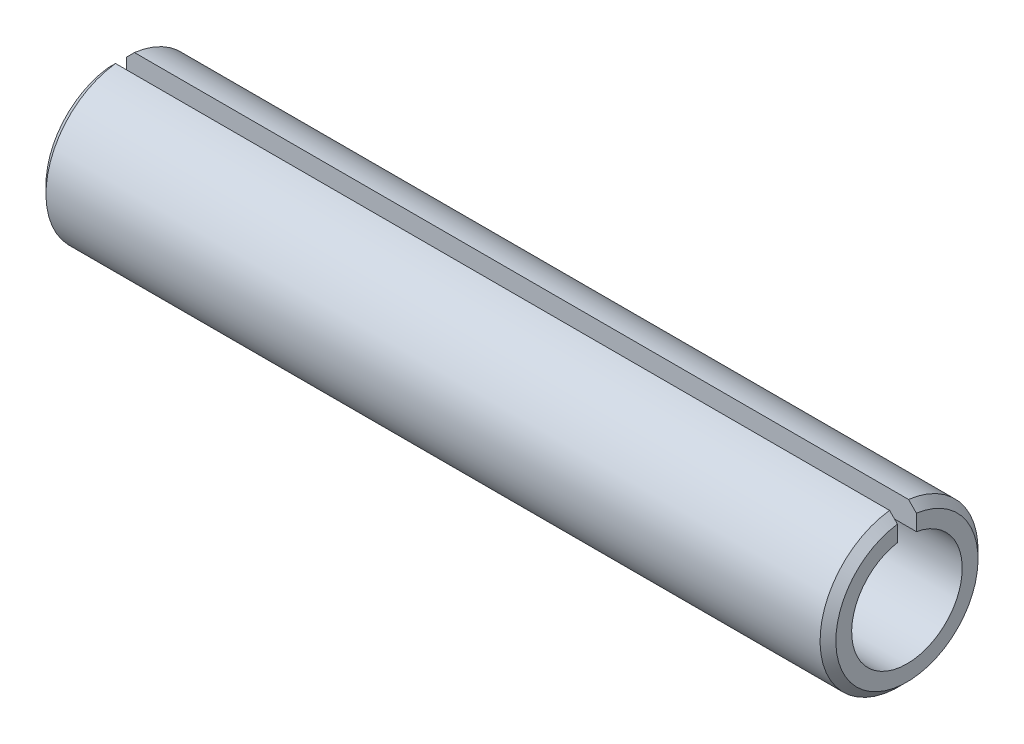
ISO-10303-21;
HEADER;
FILE_DESCRIPTION(('STEP AP214'),'2;1');
FILE_NAME('part.step','',(''),(''),'','','');
FILE_SCHEMA(('AUTOMOTIVE_DESIGN { 1 0 10303 214 1 1 1 1 }'));
ENDSEC;
DATA;
#1=APPLICATION_CONTEXT('core data for automotive mechanical design processes');
#2=APPLICATION_PROTOCOL_DEFINITION('international standard','automotive_design',2000,#1);
#3=PRODUCT_CONTEXT('',#1,'mechanical');
#4=PRODUCT('Part','Part','',(#3));
#5=PRODUCT_RELATED_PRODUCT_CATEGORY('part','',(#4));
#6=PRODUCT_DEFINITION_FORMATION('','',#4);
#7=PRODUCT_DEFINITION_CONTEXT('part definition',#1,'design');
#8=PRODUCT_DEFINITION('design','',#6,#7);
#9=PRODUCT_DEFINITION_SHAPE('','',#8);
#10=(LENGTH_UNIT() NAMED_UNIT(*) SI_UNIT(.MILLI.,.METRE.));
#11=(NAMED_UNIT(*) PLANE_ANGLE_UNIT() SI_UNIT($,.RADIAN.));
#12=(NAMED_UNIT(*) SI_UNIT($,.STERADIAN.) SOLID_ANGLE_UNIT());
#13=UNCERTAINTY_MEASURE_WITH_UNIT(LENGTH_MEASURE(1.E-05),#10,'distance_accuracy_value','');
#14=(GEOMETRIC_REPRESENTATION_CONTEXT(3) GLOBAL_UNCERTAINTY_ASSIGNED_CONTEXT((#13)) GLOBAL_UNIT_ASSIGNED_CONTEXT((#10,
#11,#12)) REPRESENTATION_CONTEXT('',''));
#15=CARTESIAN_POINT('',(0.,0.,0.));
#16=DIRECTION('',(0.,0.,1.));
#17=DIRECTION('',(1.,0.,0.));
#18=AXIS2_PLACEMENT_3D('',#15,#16,#17);
#19=CARTESIAN_POINT('',(0.,0.,0.));
#20=DIRECTION('',(-1.,0.,0.));
#21=DIRECTION('',(0.,0.,1.));
#22=AXIS2_PLACEMENT_3D('',#19,#20,#21);
#23=CYLINDRICAL_SURFACE('',#22,1.4);
#24=DIRECTION('',(-1.,0.,0.));
#25=VECTOR('',#24,1.);
#26=CARTESIAN_POINT('',(20.,1.37927517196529,0.240000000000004));
#27=LINE('',#26,#25);
#28=CARTESIAN_POINT('',(20.,1.37927517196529,0.240000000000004));
#29=VERTEX_POINT('',#28);
#30=CARTESIAN_POINT('',(1.80411241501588E-13,1.37927517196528,0.240000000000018));
#31=VERTEX_POINT('',#30);
#32=EDGE_CURVE('E45',#29,#31,#27,.T.);
#33=ORIENTED_EDGE('',*,*,#32,.F.);
#34=CARTESIAN_POINT('',(20.,0.,0.));
#35=DIRECTION('',(-1.,0.,0.));
#36=DIRECTION('',(0.,0.,1.));
#37=AXIS2_PLACEMENT_3D('',#34,#35,#36);
#38=CIRCLE('',#37,1.4);
#39=CARTESIAN_POINT('',(20.,1.37927517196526,-0.239999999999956));
#40=VERTEX_POINT('',#39);
#41=EDGE_CURVE('E11',#40,#29,#38,.T.);
#42=ORIENTED_EDGE('',*,*,#41,.F.);
#43=DIRECTION('',(-1.,0.,0.));
#44=VECTOR('',#43,1.);
#45=CARTESIAN_POINT('',(20.,1.37927517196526,-0.239999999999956));
#46=LINE('',#45,#44);
#47=CARTESIAN_POINT('',(1.80411241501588E-13,1.37927517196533,-0.23999999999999));
#48=VERTEX_POINT('',#47);
#49=EDGE_CURVE('E83',#40,#48,#46,.T.);
#50=ORIENTED_EDGE('',*,*,#49,.T.);
#51=CARTESIAN_POINT('',(0.,0.,0.));
#52=DIRECTION('',(-1.,0.,0.));
#53=DIRECTION('',(0.,0.,1.));
#54=AXIS2_PLACEMENT_3D('',#51,#52,#53);
#55=CIRCLE('',#54,1.4);
#56=EDGE_CURVE('E95',#48,#31,#55,.T.);
#57=ORIENTED_EDGE('',*,*,#56,.T.);
#58=EDGE_LOOP('',(#33,#42,#50,#57));
#59=FACE_BOUND('',#58,.T.);
#60=ADVANCED_FACE('F31',(#59),#23,.F.);
#61=CARTESIAN_POINT('',(20.,1.39999999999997,0.));
#62=DIRECTION('',(-1.,0.,0.));
#63=DIRECTION('',(0.,0.,1.));
#64=AXIS2_PLACEMENT_3D('',#61,#62,#63);
#65=PLANE('',#64);
#66=DIRECTION('',(0.,-1.00000000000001,0.));
#67=VECTOR('',#66,1.);
#68=CARTESIAN_POINT('',(20.,1.9855477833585,0.240000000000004));
#69=LINE('',#68,#67);
#70=CARTESIAN_POINT('',(20.,1.78392824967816,0.240000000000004));
#71=VERTEX_POINT('',#70);
#72=EDGE_CURVE('E89',#71,#29,#69,.T.);
#73=ORIENTED_EDGE('',*,*,#72,.F.);
#74=CARTESIAN_POINT('',(20.,0.,0.));
#75=DIRECTION('',(-1.,0.,0.));
#76=DIRECTION('',(0.,0.,1.));
#77=AXIS2_PLACEMENT_3D('',#74,#75,#76);
#78=CIRCLE('',#77,1.8);
#79=CARTESIAN_POINT('',(20.,1.78392824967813,-0.239999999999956));
#80=VERTEX_POINT('',#79);
#81=EDGE_CURVE('E38',#80,#71,#78,.T.);
#82=ORIENTED_EDGE('',*,*,#81,.F.);
#83=DIRECTION('',(0.,-1.00000000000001,0.));
#84=VECTOR('',#83,1.);
#85=CARTESIAN_POINT('',(20.,1.98554778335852,-0.240000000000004));
#86=LINE('',#85,#84);
#87=EDGE_CURVE('E128',#80,#40,#86,.T.);
#88=ORIENTED_EDGE('',*,*,#87,.T.);
#89=ORIENTED_EDGE('',*,*,#41,.T.);
#90=EDGE_LOOP('',(#73,#82,#88,#89));
#91=FACE_BOUND('',#90,.T.);
#92=ADVANCED_FACE('F127',(#91),#65,.F.);
#93=CARTESIAN_POINT('',(20.,0.,0.));
#94=DIRECTION('',(-1.,0.,0.));
#95=DIRECTION('',(0.,0.,1.));
#96=AXIS2_PLACEMENT_3D('',#93,#94,#95);
#97=CONICAL_SURFACE('',#96,1.8,0.785398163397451);
#98=CARTESIAN_POINT('',(19.0852679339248,2.70410247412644,0.239999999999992));
#99=CARTESIAN_POINT('',(19.2317351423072,2.55703131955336,0.240000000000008));
#100=CARTESIAN_POINT('',(19.3781811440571,2.40993875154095,0.240000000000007));
#101=CARTESIAN_POINT('',(19.6709060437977,2.1155896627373,0.240000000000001));
#102=CARTESIAN_POINT('',(19.8171849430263,1.9683331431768,0.239999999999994));
#103=CARTESIAN_POINT('',(20.0363868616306,1.74723213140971,0.239999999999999));
#104=CARTESIAN_POINT('',(20.1094184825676,1.67349536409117,0.240000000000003));
#105=CARTESIAN_POINT('',(20.2553690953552,1.52591073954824,0.240000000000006));
#106=CARTESIAN_POINT('',(20.3282880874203,1.45206288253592,0.240000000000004));
#107=CARTESIAN_POINT('',(20.4739618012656,1.30420373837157,0.240000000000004));
#108=CARTESIAN_POINT('',(20.5467165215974,1.23019244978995,0.240000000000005));
#109=CARTESIAN_POINT('',(20.6919207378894,1.08187026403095,0.240000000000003));
#110=CARTESIAN_POINT('',(20.7643702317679,1.00755936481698,0.24));
#111=CARTESIAN_POINT('',(20.8365964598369,0.933030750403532,0.23999999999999));
#112=B_SPLINE_CURVE_WITH_KNOTS('',3,(#98,#99,#100,#101,#102,#103,#104,#105,#106,#107,#108,#109,
#110,#111),.UNSPECIFIED.,.F.,.F.,(4,2,2,2,2,2,4),(0.,0.62269056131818,1.24537647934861,
1.55672273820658,1.86806840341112,2.1794168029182,2.49076732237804),.UNSPECIFIED.);
#113=CARTESIAN_POINT('',(19.8,1.9855477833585,0.240000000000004));
#114=VERTEX_POINT('',#113);
#115=EDGE_CURVE('E100',#114,#71,#112,.T.);
#116=ORIENTED_EDGE('',*,*,#115,.F.);
#117=CARTESIAN_POINT('',(19.8,0.,0.));
#118=DIRECTION('',(-1.,0.,0.));
#119=DIRECTION('',(0.,0.,1.));
#120=AXIS2_PLACEMENT_3D('',#117,#118,#119);
#121=CIRCLE('',#120,2.);
#122=CARTESIAN_POINT('',(19.8,1.98554778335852,-0.240000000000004));
#123=VERTEX_POINT('',#122);
#124=EDGE_CURVE('E115',#123,#114,#121,.T.);
#125=ORIENTED_EDGE('',*,*,#124,.F.);
#126=CARTESIAN_POINT('',(19.0852679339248,2.70410247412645,-0.240000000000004));
#127=CARTESIAN_POINT('',(19.2317351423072,2.55703131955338,-0.240000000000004));
#128=CARTESIAN_POINT('',(19.3781811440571,2.40993875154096,-0.240000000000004));
#129=CARTESIAN_POINT('',(19.6709060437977,2.11558966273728,-0.240000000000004));
#130=CARTESIAN_POINT('',(19.8171849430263,1.96833314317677,-0.240000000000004));
#131=CARTESIAN_POINT('',(20.0363868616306,1.74723213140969,-0.240000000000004));
#132=CARTESIAN_POINT('',(20.1094184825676,1.67349536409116,-0.240000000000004));
#133=CARTESIAN_POINT('',(20.2553690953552,1.52591073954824,-0.240000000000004));
#134=CARTESIAN_POINT('',(20.3282880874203,1.45206288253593,-0.240000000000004));
#135=CARTESIAN_POINT('',(20.4739618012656,1.30420373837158,-0.240000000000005));
#136=CARTESIAN_POINT('',(20.5467165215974,1.23019244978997,-0.240000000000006));
#137=CARTESIAN_POINT('',(20.6919207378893,1.08187026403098,-0.240000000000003));
#138=CARTESIAN_POINT('',(20.7643702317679,1.00755936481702,-0.239999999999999));
#139=CARTESIAN_POINT('',(20.8365964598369,0.933030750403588,-0.23999999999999));
#140=B_SPLINE_CURVE_WITH_KNOTS('',3,(#126,#127,#128,#129,#130,#131,#132,#133,#134,#135,#136,
#137,#138,#139),.UNSPECIFIED.,.F.,.F.,(4,2,2,2,2,2,4),(0.,0.622690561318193,1.24537647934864,
1.55672273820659,1.86806840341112,2.17941680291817,2.49076732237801),.UNSPECIFIED.);
#141=EDGE_CURVE('E124',#123,#80,#140,.T.);
#142=ORIENTED_EDGE('',*,*,#141,.T.);
#143=ORIENTED_EDGE('',*,*,#81,.T.);
#144=EDGE_LOOP('',(#116,#125,#142,#143));
#145=FACE_BOUND('',#144,.T.);
#146=ADVANCED_FACE('F122',(#145),#97,.T.);
#147=CARTESIAN_POINT('',(0.,0.,0.));
#148=DIRECTION('',(-1.,0.,0.));
#149=DIRECTION('',(0.,0.,1.));
#150=AXIS2_PLACEMENT_3D('',#147,#148,#149);
#151=CYLINDRICAL_SURFACE('',#150,2.);
#152=DIRECTION('',(-1.,0.,0.));
#153=VECTOR('',#152,1.);
#154=CARTESIAN_POINT('',(20.,1.9855477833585,0.240000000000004));
#155=LINE('',#154,#153);
#156=CARTESIAN_POINT('',(0.200000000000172,1.98554778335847,0.240000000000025));
#157=VERTEX_POINT('',#156);
#158=EDGE_CURVE('E135',#114,#157,#155,.T.);
#159=ORIENTED_EDGE('',*,*,#158,.T.);
#160=CARTESIAN_POINT('',(0.200000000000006,0.,0.));
#161=DIRECTION('',(-1.,0.,0.));
#162=DIRECTION('',(0.,0.,1.));
#163=AXIS2_PLACEMENT_3D('',#160,#161,#162);
#164=CIRCLE('',#163,2.);
#165=CARTESIAN_POINT('',(0.200000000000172,1.98554778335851,-0.23999999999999));
#166=VERTEX_POINT('',#165);
#167=EDGE_CURVE('E102',#166,#157,#164,.T.);
#168=ORIENTED_EDGE('',*,*,#167,.F.);
#169=DIRECTION('',(-1.,0.,0.));
#170=VECTOR('',#169,1.);
#171=CARTESIAN_POINT('',(20.,1.98554778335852,-0.240000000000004));
#172=LINE('',#171,#170);
#173=EDGE_CURVE('E96',#123,#166,#172,.T.);
#174=ORIENTED_EDGE('',*,*,#173,.F.);
#175=ORIENTED_EDGE('',*,*,#124,.T.);
#176=EDGE_LOOP('',(#159,#168,#174,#175));
#177=FACE_BOUND('',#176,.T.);
#178=ADVANCED_FACE('F165',(#177),#151,.T.);
#179=CARTESIAN_POINT('',(0.200000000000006,0.,0.));
#180=DIRECTION('',(1.,0.,0.));
#181=DIRECTION('',(0.,0.,-1.));
#182=AXIS2_PLACEMENT_3D('',#179,#180,#181);
#183=CONICAL_SURFACE('',#182,2.,0.78539816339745);
#184=CARTESIAN_POINT('',(-0.836596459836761,0.933030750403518,0.24000000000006));
#185=CARTESIAN_POINT('',(-0.764370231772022,1.00755936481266,0.240000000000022));
#186=CARTESIAN_POINT('',(-0.691920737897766,1.0818702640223,0.240000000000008));
#187=CARTESIAN_POINT('',(-0.546716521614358,1.23019244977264,0.239999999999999));
#188=CARTESIAN_POINT('',(-0.473961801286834,1.30420373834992,0.240000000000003));
#189=CARTESIAN_POINT('',(-0.328288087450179,1.45206288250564,0.240000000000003));
#190=CARTESIAN_POINT('',(-0.255369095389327,1.52591073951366,0.239999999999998));
#191=CARTESIAN_POINT('',(-0.109418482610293,1.67349536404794,0.240000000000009));
#192=CARTESIAN_POINT('',(-0.036386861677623,1.74723213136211,0.240000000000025));
#193=CARTESIAN_POINT('',(0.18281505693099,1.96833314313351,0.240000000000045));
#194=CARTESIAN_POINT('',(0.329093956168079,2.11558966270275,0.240000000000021));
#195=CARTESIAN_POINT('',(0.621818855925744,2.40993875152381,0.239999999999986));
#196=CARTESIAN_POINT('',(0.768264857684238,2.55703131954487,0.239999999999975));
#197=CARTESIAN_POINT('',(0.914732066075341,2.70410247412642,0.240000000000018));
#198=B_SPLINE_CURVE_WITH_KNOTS('',3,(#184,#185,#186,#187,#188,#189,#190,#191,#192,#193,#194,
#195,#196,#197),.UNSPECIFIED.,.F.,.F.,(4,2,2,2,2,2,4),(0.,0.311350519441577,0.622698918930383,
0.934044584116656,1.24539084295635,1.86807676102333,2.49076732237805),.UNSPECIFIED.);
#199=CARTESIAN_POINT('',(1.80411241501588E-13,1.78392824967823,0.240000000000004));
#200=VERTEX_POINT('',#199);
#201=EDGE_CURVE('E104',#200,#157,#198,.T.);
#202=ORIENTED_EDGE('',*,*,#201,.F.);
#203=CARTESIAN_POINT('',(0.,0.,0.));
#204=DIRECTION('',(-1.,0.,0.));
#205=DIRECTION('',(0.,0.,1.));
#206=AXIS2_PLACEMENT_3D('',#203,#204,#205);
#207=CIRCLE('',#206,1.80000000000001);
#208=CARTESIAN_POINT('',(1.80411241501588E-13,1.78392824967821,-0.239999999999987));
#209=VERTEX_POINT('',#208);
#210=EDGE_CURVE('E99',#209,#200,#207,.T.);
#211=ORIENTED_EDGE('',*,*,#210,.F.);
#212=CARTESIAN_POINT('',(-0.836596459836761,0.933030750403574,-0.239999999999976));
#213=CARTESIAN_POINT('',(-0.76437023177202,1.00755936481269,-0.240000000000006));
#214=CARTESIAN_POINT('',(-0.691920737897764,1.08187026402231,-0.240000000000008));
#215=CARTESIAN_POINT('',(-0.546716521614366,1.23019244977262,-0.240000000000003));
#216=CARTESIAN_POINT('',(-0.473961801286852,1.30420373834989,-0.239999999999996));
#217=CARTESIAN_POINT('',(-0.32828808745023,1.4520628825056,-0.240000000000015));
#218=CARTESIAN_POINT('',(-0.255369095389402,1.52591073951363,-0.240000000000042));
#219=CARTESIAN_POINT('',(-0.109418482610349,1.67349536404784,-0.239999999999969));
#220=CARTESIAN_POINT('',(-0.036386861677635,1.74723213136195,-0.239999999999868));
#221=CARTESIAN_POINT('',(0.182815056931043,1.96833314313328,-0.239999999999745));
#222=CARTESIAN_POINT('',(0.32909395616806,2.11558966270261,-0.239999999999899));
#223=CARTESIAN_POINT('',(0.621818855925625,2.4099387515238,-0.24000000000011));
#224=CARTESIAN_POINT('',(0.768264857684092,2.55703131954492,-0.240000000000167));
#225=CARTESIAN_POINT('',(0.914732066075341,2.70410247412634,-0.23999999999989));
#226=B_SPLINE_CURVE_WITH_KNOTS('',3,(#212,#213,#214,#215,#216,#217,#218,#219,#220,#221,#222,
#223,#224,#225),.UNSPECIFIED.,.F.,.F.,(4,2,2,2,2,2,4),(0.,0.311350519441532,0.622698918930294,
0.934044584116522,1.24539084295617,1.86807676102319,2.49076732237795),.UNSPECIFIED.);
#227=EDGE_CURVE('E53',#209,#166,#226,.T.);
#228=ORIENTED_EDGE('',*,*,#227,.T.);
#229=ORIENTED_EDGE('',*,*,#167,.T.);
#230=EDGE_LOOP('',(#202,#211,#228,#229));
#231=FACE_BOUND('',#230,.T.);
#232=ADVANCED_FACE('F147',(#231),#183,.T.);
#233=CARTESIAN_POINT('',(1.80411241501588E-13,1.3999999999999,1.05818132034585E-13));
#234=DIRECTION('',(-1.,0.,0.));
#235=DIRECTION('',(0.,0.,1.));
#236=AXIS2_PLACEMENT_3D('',#233,#234,#235);
#237=PLANE('',#236);
#238=ORIENTED_EDGE('',*,*,#210,.T.);
#239=DIRECTION('',(0.,-1.00000000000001,0.));
#240=VECTOR('',#239,1.);
#241=CARTESIAN_POINT('',(1.80411241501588E-13,1.98554778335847,0.240000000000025));
#242=LINE('',#241,#240);
#243=EDGE_CURVE('E90',#200,#31,#242,.T.);
#244=ORIENTED_EDGE('',*,*,#243,.T.);
#245=ORIENTED_EDGE('',*,*,#56,.F.);
#246=DIRECTION('',(0.,-1.00000000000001,0.));
#247=VECTOR('',#246,1.);
#248=CARTESIAN_POINT('',(1.80411241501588E-13,1.98554778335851,-0.23999999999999));
#249=LINE('',#248,#247);
#250=EDGE_CURVE('E80',#209,#48,#249,.T.);
#251=ORIENTED_EDGE('',*,*,#250,.F.);
#252=EDGE_LOOP('',(#238,#244,#245,#251));
#253=FACE_BOUND('',#252,.T.);
#254=ADVANCED_FACE('F98',(#253),#237,.T.);
#255=CARTESIAN_POINT('',(20.,1.98554778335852,-0.240000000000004));
#256=DIRECTION('',(0.,0.,-1.));
#257=DIRECTION('',(0.,1.00000000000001,0.));
#258=AXIS2_PLACEMENT_3D('',#255,#256,#257);
#259=PLANE('',#258);
#260=ORIENTED_EDGE('',*,*,#173,.T.);
#261=ORIENTED_EDGE('',*,*,#227,.F.);
#262=ORIENTED_EDGE('',*,*,#250,.T.);
#263=ORIENTED_EDGE('',*,*,#49,.F.);
#264=ORIENTED_EDGE('',*,*,#87,.F.);
#265=ORIENTED_EDGE('',*,*,#141,.F.);
#266=EDGE_LOOP('',(#260,#261,#262,#263,#264,#265));
#267=FACE_BOUND('',#266,.T.);
#268=ADVANCED_FACE('F82',(#267),#259,.F.);
#269=CARTESIAN_POINT('',(20.,1.9855477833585,0.240000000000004));
#270=DIRECTION('',(0.,0.,-1.));
#271=DIRECTION('',(0.,1.00000000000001,0.));
#272=AXIS2_PLACEMENT_3D('',#269,#270,#271);
#273=PLANE('',#272);
#274=ORIENTED_EDGE('',*,*,#115,.T.);
#275=ORIENTED_EDGE('',*,*,#72,.T.);
#276=ORIENTED_EDGE('',*,*,#32,.T.);
#277=ORIENTED_EDGE('',*,*,#243,.F.);
#278=ORIENTED_EDGE('',*,*,#201,.T.);
#279=ORIENTED_EDGE('',*,*,#158,.F.);
#280=EDGE_LOOP('',(#274,#275,#276,#277,#278,#279));
#281=FACE_BOUND('',#280,.T.);
#282=ADVANCED_FACE('F153',(#281),#273,.T.);
#283=CLOSED_SHELL('',(#60,#92,#146,#178,#232,#254,#268,#282));
#284=MANIFOLD_SOLID_BREP('B2',#283);
#285=ADVANCED_BREP_SHAPE_REPRESENTATION('',(#18,#284),#14);
#286=SHAPE_DEFINITION_REPRESENTATION(#9,#285);
ENDSEC;
END-ISO-10303-21;
